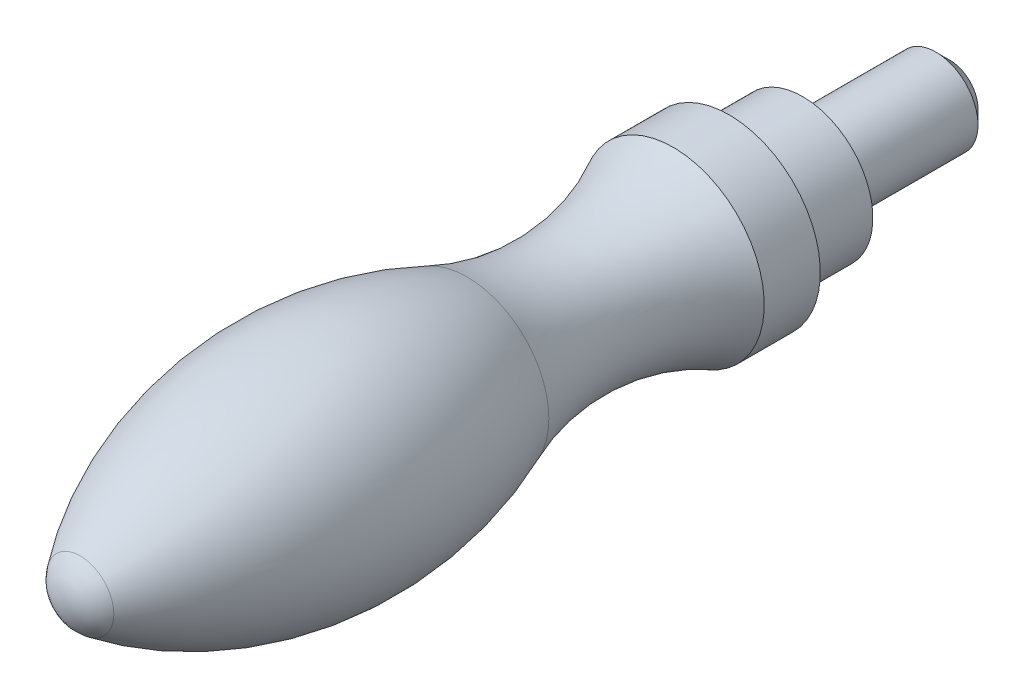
ISO-10303-21;
HEADER;
FILE_DESCRIPTION(('STEP AP214'),'2;1');
FILE_NAME('part.step','',(''),(''),'','','');
FILE_SCHEMA(('AUTOMOTIVE_DESIGN { 1 0 10303 214 1 1 1 1 }'));
ENDSEC;
DATA;
#1=APPLICATION_CONTEXT('core data for automotive mechanical design processes');
#2=APPLICATION_PROTOCOL_DEFINITION('international standard','automotive_design',2000,#1);
#3=PRODUCT_CONTEXT('',#1,'mechanical');
#4=PRODUCT('Part','Part','',(#3));
#5=PRODUCT_RELATED_PRODUCT_CATEGORY('part','',(#4));
#6=PRODUCT_DEFINITION_FORMATION('','',#4);
#7=PRODUCT_DEFINITION_CONTEXT('part definition',#1,'design');
#8=PRODUCT_DEFINITION('design','',#6,#7);
#9=PRODUCT_DEFINITION_SHAPE('','',#8);
#10=(LENGTH_UNIT() NAMED_UNIT(*) SI_UNIT(.MILLI.,.METRE.));
#11=(NAMED_UNIT(*) PLANE_ANGLE_UNIT() SI_UNIT($,.RADIAN.));
#12=(NAMED_UNIT(*) SI_UNIT($,.STERADIAN.) SOLID_ANGLE_UNIT());
#13=UNCERTAINTY_MEASURE_WITH_UNIT(LENGTH_MEASURE(1.E-05),#10,'distance_accuracy_value','');
#14=(GEOMETRIC_REPRESENTATION_CONTEXT(3) GLOBAL_UNCERTAINTY_ASSIGNED_CONTEXT((#13)) GLOBAL_UNIT_ASSIGNED_CONTEXT((#10,
#11,#12)) REPRESENTATION_CONTEXT('',''));
#15=CARTESIAN_POINT('',(0.,0.,0.));
#16=DIRECTION('',(0.,0.,1.));
#17=DIRECTION('',(1.,0.,0.));
#18=AXIS2_PLACEMENT_3D('',#15,#16,#17);
#19=CARTESIAN_POINT('',(6.071494,-6.092385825,-21.));
#20=DIRECTION('',(0.,0.,-1.));
#21=DIRECTION('',(-1.,0.,0.));
#22=AXIS2_PLACEMENT_3D('',#19,#20,#21);
#23=PLANE('',#22);
#24=CARTESIAN_POINT('',(0.,0.,-21.));
#25=DIRECTION('',(0.,0.,-1.));
#26=DIRECTION('',(-1.,0.,0.));
#27=AXIS2_PLACEMENT_3D('',#24,#25,#26);
#28=CIRCLE('',#27,3.9995);
#29=CARTESIAN_POINT('',(-3.9995,0.,-21.));
#30=VERTEX_POINT('',#29);
#31=EDGE_CURVE('E9',#30,#30,#28,.T.);
#32=ORIENTED_EDGE('',*,*,#31,.T.);
#33=EDGE_LOOP('',(#32));
#34=FACE_BOUND('',#33,.T.);
#35=DIRECTION('',(0.866025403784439,0.5,0.));
#36=VECTOR('',#35,1.);
#37=CARTESIAN_POINT('',(-3.,1.73205080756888,-21.));
#38=LINE('',#37,#36);
#39=CARTESIAN_POINT('',(-3.,1.73205080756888,-21.));
#40=VERTEX_POINT('',#39);
#41=CARTESIAN_POINT('',(0.,3.46410161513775,-21.));
#42=VERTEX_POINT('',#41);
#43=EDGE_CURVE('E29',#40,#42,#38,.T.);
#44=ORIENTED_EDGE('',*,*,#43,.F.);
#45=DIRECTION('',(0.,1.,0.));
#46=VECTOR('',#45,1.);
#47=CARTESIAN_POINT('',(-3.,-1.73205080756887,-21.));
#48=LINE('',#47,#46);
#49=CARTESIAN_POINT('',(-3.,-1.73205080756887,-21.));
#50=VERTEX_POINT('',#49);
#51=EDGE_CURVE('E88',#50,#40,#48,.T.);
#52=ORIENTED_EDGE('',*,*,#51,.F.);
#53=DIRECTION('',(-0.866025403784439,0.5,0.));
#54=VECTOR('',#53,1.);
#55=CARTESIAN_POINT('',(0.,-3.46410161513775,-21.));
#56=LINE('',#55,#54);
#57=CARTESIAN_POINT('',(0.,-3.46410161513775,-21.));
#58=VERTEX_POINT('',#57);
#59=EDGE_CURVE('E91',#58,#50,#56,.T.);
#60=ORIENTED_EDGE('',*,*,#59,.F.);
#61=DIRECTION('',(-0.866025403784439,-0.5,0.));
#62=VECTOR('',#61,1.);
#63=CARTESIAN_POINT('',(3.,-1.73205080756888,-21.));
#64=LINE('',#63,#62);
#65=CARTESIAN_POINT('',(3.,-1.73205080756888,-21.));
#66=VERTEX_POINT('',#65);
#67=EDGE_CURVE('E107',#66,#58,#64,.T.);
#68=ORIENTED_EDGE('',*,*,#67,.F.);
#69=DIRECTION('',(0.,-1.,0.));
#70=VECTOR('',#69,1.);
#71=CARTESIAN_POINT('',(3.,1.73205080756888,-21.));
#72=LINE('',#71,#70);
#73=CARTESIAN_POINT('',(3.,1.73205080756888,-21.));
#74=VERTEX_POINT('',#73);
#75=EDGE_CURVE('E104',#74,#66,#72,.T.);
#76=ORIENTED_EDGE('',*,*,#75,.F.);
#77=DIRECTION('',(0.866025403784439,-0.5,0.));
#78=VECTOR('',#77,1.);
#79=CARTESIAN_POINT('',(0.,3.46410161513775,-21.));
#80=LINE('',#79,#78);
#81=EDGE_CURVE('E102',#42,#74,#80,.T.);
#82=ORIENTED_EDGE('',*,*,#81,.F.);
#83=EDGE_LOOP('',(#44,#52,#60,#68,#76,#82));
#84=FACE_BOUND('',#83,.T.);
#85=ADVANCED_FACE('F14',(#34,#84),#23,.T.);
#86=CARTESIAN_POINT('',(0.,0.,0.));
#87=DIRECTION('',(0.,0.,-1.));
#88=DIRECTION('',(-1.,0.,0.));
#89=AXIS2_PLACEMENT_3D('',#86,#87,#88);
#90=CYLINDRICAL_SURFACE('',#89,5.9995);
#91=CARTESIAN_POINT('',(0.,0.,-19.));
#92=DIRECTION('',(0.,0.,-1.));
#93=DIRECTION('',(-1.,0.,0.));
#94=AXIS2_PLACEMENT_3D('',#91,#92,#93);
#95=CIRCLE('',#94,5.9995);
#96=CARTESIAN_POINT('',(-5.9995,0.,-19.));
#97=VERTEX_POINT('',#96);
#98=EDGE_CURVE('E22',#97,#97,#95,.F.);
#99=ORIENTED_EDGE('',*,*,#98,.T.);
#100=EDGE_LOOP('',(#99));
#101=FACE_BOUND('',#100,.T.);
#102=CARTESIAN_POINT('',(0.,0.,0.));
#103=DIRECTION('',(0.,0.,-1.));
#104=DIRECTION('',(-1.,0.,0.));
#105=AXIS2_PLACEMENT_3D('',#102,#103,#104);
#106=CIRCLE('',#105,5.9995);
#107=CARTESIAN_POINT('',(-5.9995,0.,0.));
#108=VERTEX_POINT('',#107);
#109=EDGE_CURVE('E114',#108,#108,#106,.F.);
#110=ORIENTED_EDGE('',*,*,#109,.F.);
#111=EDGE_LOOP('',(#110));
#112=FACE_BOUND('',#111,.T.);
#113=ADVANCED_FACE('F146',(#101,#112),#90,.T.);
#114=CARTESIAN_POINT('',(10.119494,-10.154314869,0.));
#115=DIRECTION('',(0.,0.,-1.));
#116=DIRECTION('',(-1.,0.,0.));
#117=AXIS2_PLACEMENT_3D('',#114,#115,#116);
#118=PLANE('',#117);
#119=ORIENTED_EDGE('',*,*,#109,.T.);
#120=EDGE_LOOP('',(#119));
#121=FACE_BOUND('',#120,.T.);
#122=CARTESIAN_POINT('',(0.,0.,0.));
#123=DIRECTION('',(0.,0.,-1.));
#124=DIRECTION('',(-1.,0.,0.));
#125=AXIS2_PLACEMENT_3D('',#122,#123,#124);
#126=CIRCLE('',#125,9.9995);
#127=CARTESIAN_POINT('',(-9.9995,0.,0.));
#128=VERTEX_POINT('',#127);
#129=EDGE_CURVE('E139',#128,#128,#126,.F.);
#130=ORIENTED_EDGE('',*,*,#129,.F.);
#131=EDGE_LOOP('',(#130));
#132=FACE_BOUND('',#131,.T.);
#133=ADVANCED_FACE('F184',(#121,#132),#118,.T.);
#134=CARTESIAN_POINT('',(0.,0.,10.5));
#135=DIRECTION('',(0.,0.,-1.));
#136=DIRECTION('',(-1.,0.,0.));
#137=AXIS2_PLACEMENT_3D('',#134,#135,#136);
#138=CYLINDRICAL_SURFACE('',#137,9.9995);
#139=CARTESIAN_POINT('',(0.,0.,10.5));
#140=DIRECTION('',(0.,0.,-1.));
#141=DIRECTION('',(-1.,0.,0.));
#142=AXIS2_PLACEMENT_3D('',#139,#140,#141);
#143=CIRCLE('',#142,9.9995);
#144=CARTESIAN_POINT('',(-9.9995,0.,10.5));
#145=VERTEX_POINT('',#144);
#146=EDGE_CURVE('E126',#145,#145,#143,.F.);
#147=ORIENTED_EDGE('',*,*,#146,.F.);
#148=EDGE_LOOP('',(#147));
#149=FACE_BOUND('',#148,.T.);
#150=ORIENTED_EDGE('',*,*,#129,.T.);
#151=EDGE_LOOP('',(#150));
#152=FACE_BOUND('',#151,.T.);
#153=ADVANCED_FACE('F183',(#149,#152),#138,.T.);
#154=CARTESIAN_POINT('',(0.000499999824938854,0.,99.4999988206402));
#155=DIRECTION('',(0.,-1.,0.));
#156=DIRECTION('',(-1.,0.,0.));
#157=AXIS2_PLACEMENT_3D('',#154,#155,#156);
#158=CIRCLE('',#157,6.00000120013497);
#159=TRIMMED_CURVE('',#158,(PARAMETER_VALUE(-1.57071299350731)),
(PARAMETER_VALUE(1.57071299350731)),.T.,.PARAMETER.);
#160=CARTESIAN_POINT('',(0.,0.,99.4999988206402));
#161=DIRECTION('',(0.,0.,-1.));
#162=AXIS1_PLACEMENT('',#160,#161);
#163=SURFACE_OF_REVOLUTION('',#159,#162);
#164=CARTESIAN_POINT('',(0.,0.,105.499999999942));
#165=VERTEX_POINT('',#164);
#166=VERTEX_LOOP('',#165);
#167=FACE_BOUND('',#166,.T.);
#168=CARTESIAN_POINT('',(0.,0.,103.099996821));
#169=DIRECTION('',(0.,0.,-1.));
#170=DIRECTION('',(-1.,0.,0.));
#171=AXIS2_PLACEMENT_3D('',#168,#169,#170);
#172=CIRCLE('',#171,4.799503);
#173=CARTESIAN_POINT('',(-4.799503,0.,103.099996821));
#174=VERTEX_POINT('',#173);
#175=EDGE_CURVE('E122',#174,#174,#172,.T.);
#176=ORIENTED_EDGE('',*,*,#175,.F.);
#177=EDGE_LOOP('',(#176));
#178=FACE_BOUND('',#177,.T.);
#179=ADVANCED_FACE('F179',(#167,#178),#163,.T.);
#180=CARTESIAN_POINT('',(13.155494,-13.200761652,10.5));
#181=DIRECTION('',(0.,0.,-1.));
#182=DIRECTION('',(-1.,0.,0.));
#183=AXIS2_PLACEMENT_3D('',#180,#181,#182);
#184=PLANE('',#183);
#185=ORIENTED_EDGE('',*,*,#146,.T.);
#186=EDGE_LOOP('',(#185));
#187=FACE_BOUND('',#186,.T.);
#188=CARTESIAN_POINT('',(0.,0.,10.5));
#189=DIRECTION('',(0.,0.,-1.));
#190=DIRECTION('',(-1.,0.,0.));
#191=AXIS2_PLACEMENT_3D('',#188,#189,#190);
#192=CIRCLE('',#191,12.9995);
#193=CARTESIAN_POINT('',(-12.9995,0.,10.5));
#194=VERTEX_POINT('',#193);
#195=EDGE_CURVE('E125',#194,#194,#192,.F.);
#196=ORIENTED_EDGE('',*,*,#195,.F.);
#197=EDGE_LOOP('',(#196));
#198=FACE_BOUND('',#197,.T.);
#199=ADVANCED_FACE('F175',(#187,#198),#184,.T.);
#200=CARTESIAN_POINT('',(0.,0.,69.4999988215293));
#201=DIRECTION('',(0.,0.,-1.));
#202=DIRECTION('',(-1.,0.,0.));
#203=AXIS2_PLACEMENT_3D('',#200,#201,#202);
#204=DEGENERATE_TOROIDAL_SURFACE('',#203,40.000499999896,56.0000011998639,.F.);
#205=CARTESIAN_POINT('',(0.,0.,47.898282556));
#206=DIRECTION('',(0.,0.,1.));
#207=DIRECTION('',(1.,0.,0.));
#208=AXIS2_PLACEMENT_3D('',#205,#206,#207);
#209=CIRCLE('',#208,11.665407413);
#210=CARTESIAN_POINT('',(11.665407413,0.,47.898282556));
#211=VERTEX_POINT('',#210);
#212=EDGE_CURVE('E127',#211,#211,#209,.T.);
#213=ORIENTED_EDGE('',*,*,#212,.T.);
#214=EDGE_LOOP('',(#213));
#215=FACE_BOUND('',#214,.T.);
#216=ORIENTED_EDGE('',*,*,#175,.T.);
#217=EDGE_LOOP('',(#216));
#218=FACE_BOUND('',#217,.T.);
#219=ADVANCED_FACE('F167',(#215,#218),#204,.F.);
#220=CARTESIAN_POINT('',(0.,0.,18.500000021));
#221=DIRECTION('',(0.,0.,-1.));
#222=DIRECTION('',(-1.,0.,0.));
#223=AXIS2_PLACEMENT_3D('',#220,#221,#222);
#224=CYLINDRICAL_SURFACE('',#223,12.9995);
#225=ORIENTED_EDGE('',*,*,#195,.T.);
#226=EDGE_LOOP('',(#225));
#227=FACE_BOUND('',#226,.T.);
#228=CARTESIAN_POINT('',(0.,0.,18.500000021));
#229=DIRECTION('',(0.,0.,-1.));
#230=DIRECTION('',(-1.,0.,0.));
#231=AXIS2_PLACEMENT_3D('',#228,#229,#230);
#232=CIRCLE('',#231,12.9995);
#233=CARTESIAN_POINT('',(-12.9995,0.,18.500000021));
#234=VERTEX_POINT('',#233);
#235=EDGE_CURVE('E130',#234,#234,#232,.T.);
#236=ORIENTED_EDGE('',*,*,#235,.T.);
#237=EDGE_LOOP('',(#236));
#238=FACE_BOUND('',#237,.T.);
#239=ADVANCED_FACE('F159',(#227,#238),#224,.T.);
#240=CARTESIAN_POINT('',(0.,0.,34.611035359));
#241=DIRECTION('',(0.,0.,-1.));
#242=DIRECTION('',(-1.,0.,0.));
#243=AXIS2_PLACEMENT_3D('',#240,#241,#242);
#244=TOROIDAL_SURFACE('',#243,43.4451824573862,34.4456824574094);
#245=ORIENTED_EDGE('',*,*,#212,.F.);
#246=EDGE_LOOP('',(#245));
#247=FACE_BOUND('',#246,.T.);
#248=ORIENTED_EDGE('',*,*,#235,.F.);
#249=EDGE_LOOP('',(#248));
#250=FACE_BOUND('',#249,.T.);
#251=ADVANCED_FACE('F157',(#247,#250),#244,.F.);
#252=CARTESIAN_POINT('',(-3.,1.73205080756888,-16.));
#253=DIRECTION('',(-0.5,0.866025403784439,0.));
#254=DIRECTION('',(-0.866025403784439,-0.5,0.));
#255=AXIS2_PLACEMENT_3D('',#252,#253,#254);
#256=PLANE('',#255);
#257=ORIENTED_EDGE('',*,*,#43,.T.);
#258=DIRECTION('',(0.,0.,-1.));
#259=VECTOR('',#258,1.);
#260=CARTESIAN_POINT('',(0.,3.46410161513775,-16.));
#261=LINE('',#260,#259);
#262=CARTESIAN_POINT('',(0.,3.46410161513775,-16.));
#263=VERTEX_POINT('',#262);
#264=EDGE_CURVE('E65',#263,#42,#261,.T.);
#265=ORIENTED_EDGE('',*,*,#264,.F.);
#266=DIRECTION('',(0.866025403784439,0.5,0.));
#267=VECTOR('',#266,1.);
#268=CARTESIAN_POINT('',(-3.,1.73205080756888,-16.));
#269=LINE('',#268,#267);
#270=CARTESIAN_POINT('',(-3.,1.73205080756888,-16.));
#271=VERTEX_POINT('',#270);
#272=EDGE_CURVE('E69',#271,#263,#269,.T.);
#273=ORIENTED_EDGE('',*,*,#272,.F.);
#274=DIRECTION('',(0.,0.,-1.));
#275=VECTOR('',#274,1.);
#276=CARTESIAN_POINT('',(-3.,1.73205080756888,-16.));
#277=LINE('',#276,#275);
#278=EDGE_CURVE('E112',#271,#40,#277,.T.);
#279=ORIENTED_EDGE('',*,*,#278,.T.);
#280=EDGE_LOOP('',(#257,#265,#273,#279));
#281=FACE_BOUND('',#280,.T.);
#282=ADVANCED_FACE('F67',(#281),#256,.F.);
#283=CARTESIAN_POINT('',(-3.,-1.73205080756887,-16.));
#284=DIRECTION('',(-1.,0.,0.));
#285=DIRECTION('',(0.,-1.,0.));
#286=AXIS2_PLACEMENT_3D('',#283,#284,#285);
#287=PLANE('',#286);
#288=ORIENTED_EDGE('',*,*,#51,.T.);
#289=ORIENTED_EDGE('',*,*,#278,.F.);
#290=DIRECTION('',(0.,1.,0.));
#291=VECTOR('',#290,1.);
#292=CARTESIAN_POINT('',(-3.,-1.73205080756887,-16.));
#293=LINE('',#292,#291);
#294=CARTESIAN_POINT('',(-3.,-1.73205080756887,-16.));
#295=VERTEX_POINT('',#294);
#296=EDGE_CURVE('E75',#295,#271,#293,.T.);
#297=ORIENTED_EDGE('',*,*,#296,.F.);
#298=DIRECTION('',(0.,0.,-1.));
#299=VECTOR('',#298,1.);
#300=CARTESIAN_POINT('',(-3.,-1.73205080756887,-16.));
#301=LINE('',#300,#299);
#302=EDGE_CURVE('E115',#295,#50,#301,.T.);
#303=ORIENTED_EDGE('',*,*,#302,.T.);
#304=EDGE_LOOP('',(#288,#289,#297,#303));
#305=FACE_BOUND('',#304,.T.);
#306=ADVANCED_FACE('F165',(#305),#287,.F.);
#307=CARTESIAN_POINT('',(0.,-3.46410161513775,-16.));
#308=DIRECTION('',(-0.5,-0.866025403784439,0.));
#309=DIRECTION('',(0.866025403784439,-0.5,0.));
#310=AXIS2_PLACEMENT_3D('',#307,#308,#309);
#311=PLANE('',#310);
#312=ORIENTED_EDGE('',*,*,#59,.T.);
#313=ORIENTED_EDGE('',*,*,#302,.F.);
#314=DIRECTION('',(-0.866025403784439,0.5,0.));
#315=VECTOR('',#314,1.);
#316=CARTESIAN_POINT('',(0.,-3.46410161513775,-16.));
#317=LINE('',#316,#315);
#318=CARTESIAN_POINT('',(0.,-3.46410161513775,-16.));
#319=VERTEX_POINT('',#318);
#320=EDGE_CURVE('E98',#319,#295,#317,.T.);
#321=ORIENTED_EDGE('',*,*,#320,.F.);
#322=DIRECTION('',(0.,0.,-1.));
#323=VECTOR('',#322,1.);
#324=CARTESIAN_POINT('',(0.,-3.46410161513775,-16.));
#325=LINE('',#324,#323);
#326=EDGE_CURVE('E117',#319,#58,#325,.T.);
#327=ORIENTED_EDGE('',*,*,#326,.T.);
#328=EDGE_LOOP('',(#312,#313,#321,#327));
#329=FACE_BOUND('',#328,.T.);
#330=ADVANCED_FACE('F205',(#329),#311,.F.);
#331=CARTESIAN_POINT('',(3.,-1.73205080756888,-16.));
#332=DIRECTION('',(0.5,-0.866025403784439,0.));
#333=DIRECTION('',(0.866025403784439,0.5,0.));
#334=AXIS2_PLACEMENT_3D('',#331,#332,#333);
#335=PLANE('',#334);
#336=ORIENTED_EDGE('',*,*,#67,.T.);
#337=ORIENTED_EDGE('',*,*,#326,.F.);
#338=DIRECTION('',(-0.866025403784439,-0.5,0.));
#339=VECTOR('',#338,1.);
#340=CARTESIAN_POINT('',(3.,-1.73205080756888,-16.));
#341=LINE('',#340,#339);
#342=CARTESIAN_POINT('',(3.,-1.73205080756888,-16.));
#343=VERTEX_POINT('',#342);
#344=EDGE_CURVE('E95',#343,#319,#341,.T.);
#345=ORIENTED_EDGE('',*,*,#344,.F.);
#346=DIRECTION('',(0.,0.,-1.));
#347=VECTOR('',#346,1.);
#348=CARTESIAN_POINT('',(3.,-1.73205080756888,-16.));
#349=LINE('',#348,#347);
#350=EDGE_CURVE('E119',#343,#66,#349,.T.);
#351=ORIENTED_EDGE('',*,*,#350,.T.);
#352=EDGE_LOOP('',(#336,#337,#345,#351));
#353=FACE_BOUND('',#352,.T.);
#354=ADVANCED_FACE('F201',(#353),#335,.F.);
#355=CARTESIAN_POINT('',(3.,1.73205080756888,-16.));
#356=DIRECTION('',(1.,0.,0.));
#357=DIRECTION('',(0.,1.,0.));
#358=AXIS2_PLACEMENT_3D('',#355,#356,#357);
#359=PLANE('',#358);
#360=ORIENTED_EDGE('',*,*,#75,.T.);
#361=ORIENTED_EDGE('',*,*,#350,.F.);
#362=DIRECTION('',(0.,-1.,0.));
#363=VECTOR('',#362,1.);
#364=CARTESIAN_POINT('',(3.,1.73205080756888,-16.));
#365=LINE('',#364,#363);
#366=CARTESIAN_POINT('',(3.,1.73205080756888,-16.));
#367=VERTEX_POINT('',#366);
#368=EDGE_CURVE('E83',#367,#343,#365,.T.);
#369=ORIENTED_EDGE('',*,*,#368,.F.);
#370=DIRECTION('',(0.,0.,-1.));
#371=VECTOR('',#370,1.);
#372=CARTESIAN_POINT('',(3.,1.73205080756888,-16.));
#373=LINE('',#372,#371);
#374=EDGE_CURVE('E74',#367,#74,#373,.T.);
#375=ORIENTED_EDGE('',*,*,#374,.T.);
#376=EDGE_LOOP('',(#360,#361,#369,#375));
#377=FACE_BOUND('',#376,.T.);
#378=ADVANCED_FACE('F198',(#377),#359,.F.);
#379=CARTESIAN_POINT('',(0.,3.46410161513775,-16.));
#380=DIRECTION('',(0.5,0.866025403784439,0.));
#381=DIRECTION('',(-0.866025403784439,0.5,0.));
#382=AXIS2_PLACEMENT_3D('',#379,#380,#381);
#383=PLANE('',#382);
#384=ORIENTED_EDGE('',*,*,#81,.T.);
#385=ORIENTED_EDGE('',*,*,#374,.F.);
#386=DIRECTION('',(0.866025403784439,-0.5,0.));
#387=VECTOR('',#386,1.);
#388=CARTESIAN_POINT('',(0.,3.46410161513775,-16.));
#389=LINE('',#388,#387);
#390=EDGE_CURVE('E78',#263,#367,#389,.T.);
#391=ORIENTED_EDGE('',*,*,#390,.F.);
#392=ORIENTED_EDGE('',*,*,#264,.T.);
#393=EDGE_LOOP('',(#384,#385,#391,#392));
#394=FACE_BOUND('',#393,.T.);
#395=ADVANCED_FACE('F79',(#394),#383,.F.);
#396=CARTESIAN_POINT('',(0.,3.46410161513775,-16.));
#397=DIRECTION('',(0.,0.,-1.));
#398=DIRECTION('',(-1.,0.,0.));
#399=AXIS2_PLACEMENT_3D('',#396,#397,#398);
#400=PLANE('',#399);
#401=ORIENTED_EDGE('',*,*,#272,.T.);
#402=ORIENTED_EDGE('',*,*,#390,.T.);
#403=ORIENTED_EDGE('',*,*,#368,.T.);
#404=ORIENTED_EDGE('',*,*,#344,.T.);
#405=ORIENTED_EDGE('',*,*,#320,.T.);
#406=ORIENTED_EDGE('',*,*,#296,.T.);
#407=EDGE_LOOP('',(#401,#402,#403,#404,#405,#406));
#408=FACE_BOUND('',#407,.T.);
#409=ADVANCED_FACE('F85',(#408),#400,.T.);
#410=CARTESIAN_POINT('',(0.,0.,-19.));
#411=DIRECTION('',(0.,0.,1.));
#412=DIRECTION('',(1.,0.,0.));
#413=AXIS2_PLACEMENT_3D('',#410,#411,#412);
#414=CONICAL_SURFACE('',#413,5.9995,0.785398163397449);
#415=ORIENTED_EDGE('',*,*,#31,.F.);
#416=EDGE_LOOP('',(#415));
#417=FACE_BOUND('',#416,.T.);
#418=ORIENTED_EDGE('',*,*,#98,.F.);
#419=EDGE_LOOP('',(#418));
#420=FACE_BOUND('',#419,.T.);
#421=ADVANCED_FACE('F16',(#417,#420),#414,.T.);
#422=CLOSED_SHELL('',(#85,#113,#133,#153,#179,#199,#219,#239,#251,#282,#306,#330,#354,#378,#395,
#409,#421));
#423=MANIFOLD_SOLID_BREP('B1',#422);
#424=ADVANCED_BREP_SHAPE_REPRESENTATION('',(#18,#423),#14);
#425=SHAPE_DEFINITION_REPRESENTATION(#9,#424);
ENDSEC;
END-ISO-10303-21;
